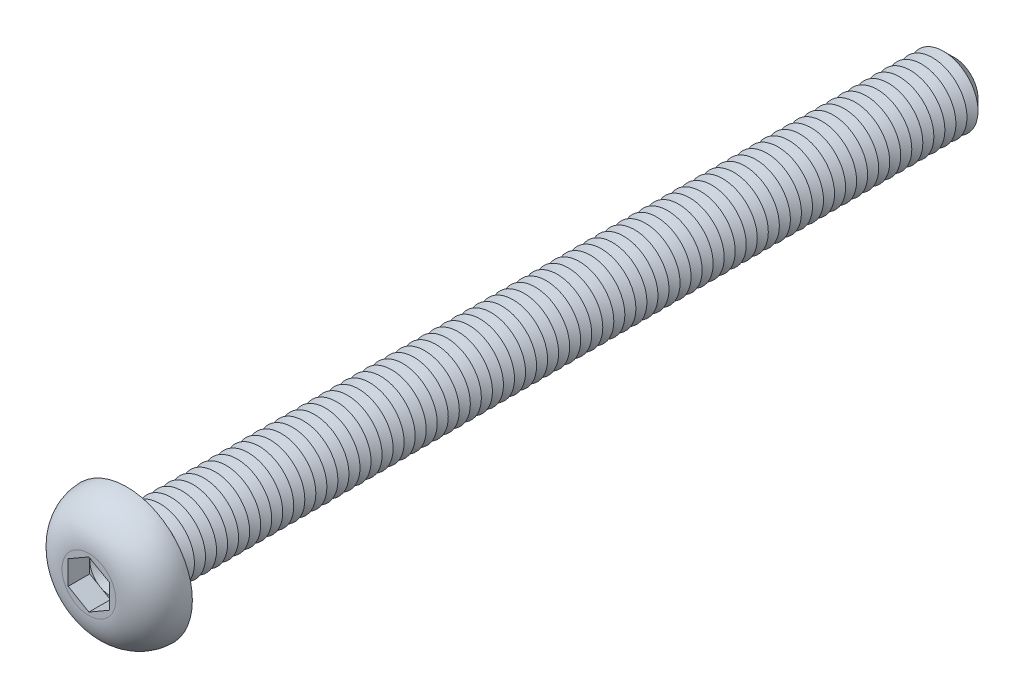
from build123d import *

# Parameters (mm, degrees)
CUT_EXTRUDE1_DEPTH  = 1.56
SKETCH4_R           = 2.5
BOSS_EXTRUDE1_DEPTH = 60
CHAMFER1_SIZE       = 0.8
LPATTERN1_COUNT     = 73
LPATTERN1_PITCH     = 0.8
FILLET2_R           = 0.4


with BuildPart() as part:
    # Sketch2 → Revolve1 (revolve)
    with BuildSketch(Plane(origin=(0, 0, 0), x_dir=(0, 0, -1), z_dir=(1, 0, 0)), mode=Mode.PRIVATE) as revolve1_sk:
        with BuildLine():
            Line((0, 0), (-2.75, 0))
            Line((-2.75, 0), (-2.75, 1.950446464))
            ThreePointArc((-2.75, 1.950446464), (-1.947498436, 3.912588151), (0, 4.75))
            Line((0, 4.75), (0, 0))
        make_face()
    revolve(revolve1_sk.sketch.rotate(Axis((0, 0, 47.934239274), (0, 0, -1)), 90), axis=Axis((0, 0, 47.934239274), (0, 0, -1)))

    # Sketch3 → Cut-Extrude1 (cut)
    with BuildSketch(Plane.XY.offset(2.75)):
        Polygon((0, 1.732050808), (-1.5, 0.866025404), (-1.5, -0.866025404), (0, -1.732050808), (1.5, -0.866025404), (1.5, 0.866025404), align=None)
    extrude(amount=-CUT_EXTRUDE1_DEPTH, mode=Mode.SUBTRACT)

    # Sketch4 → Boss-Extrude1 (add)
    with BuildSketch(Plane(origin=(0, 0, 0), x_dir=(-1, 0, 0), z_dir=(0, 0, -1))):
        with Locations(Location((0, 0, 0), (0, 0, 180))):
            Circle(SKETCH4_R)
    extrude(amount=BOSS_EXTRUDE1_DEPTH)

    # Chamfer1
    chamfer1_edges = [part.edges().sort_by_distance(p)[0] for p in [
        (-2.5, 0, -60),
    ]]
    chamfer(chamfer1_edges, length=CHAMFER1_SIZE)

    # Sketch5 → Cut-Revolve1 (revolve, cut)
    with BuildSketch(Plane(origin=(0, 0, 0), x_dir=(0, 0, -1), z_dir=(1, 0, 0)), mode=Mode.PRIVATE) as cut_revolve1_sk:
        Polygon((0.8, 2.5), (1.6, 2.5), (1.2, 1.807179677), align=None)
    cut_revolve1 = revolve(cut_revolve1_sk.sketch.rotate(Axis((0, 0, 47.934239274), (0, 0, -1)), 90), axis=Axis((0, 0, 47.934239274), (0, 0, -1)), mode=Mode.SUBTRACT)

    # LPattern1: Cut-Revolve1 ×73
    with Locations(*[(0, 0, -i * LPATTERN1_PITCH) for i in range(1, LPATTERN1_COUNT)]):
        add(cut_revolve1, mode=Mode.SUBTRACT)

    # Fillet2
    fillet2_edges = [part.edges().sort_by_distance(p)[0] for p in [
        (-2.5, 0, 0),
    ]]
    fillet(fillet2_edges, radius=FILLET2_R)

    # Cut-Extrude2 cone 1 section (on through the dimple's axis) → Cut-Extrude2 (revolve, cut)
    with BuildSketch(Plane(origin=(0, 0, 1.19), x_dir=(0, -1, 0), z_dir=(1, 0, 0))):
        Polygon((0, 0), (1.5, 0), (0, 0.866025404), align=None)
    revolve(axis=Axis((0, 0, 1.19), (0, 0, -1)), mode=Mode.SUBTRACT)


solid = part.part
